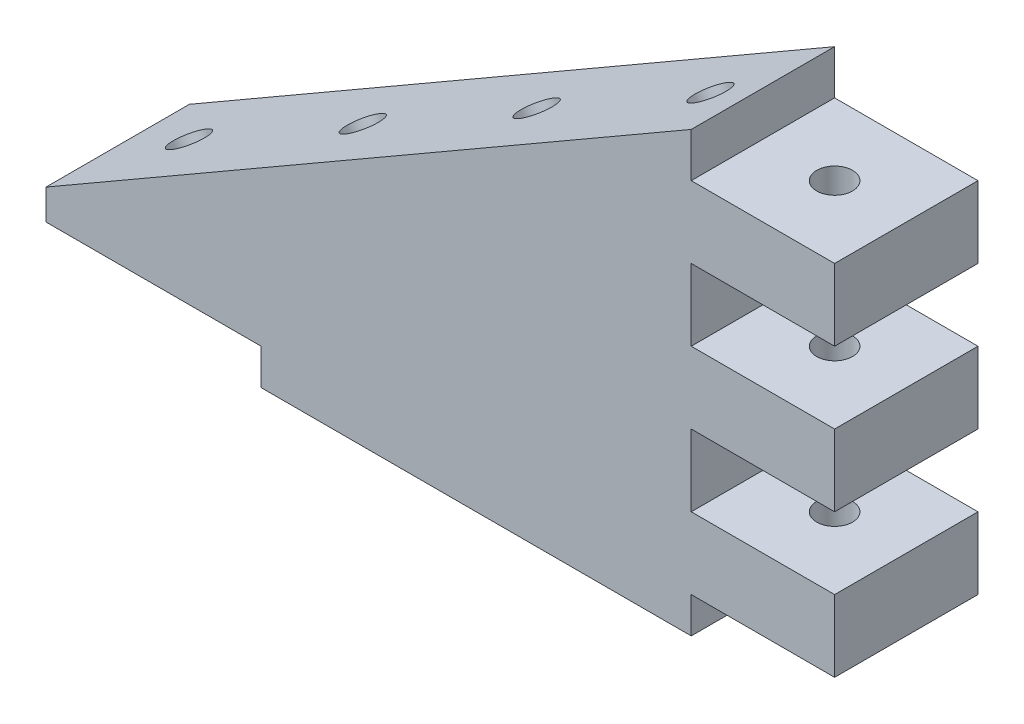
from build123d import *

# Parameters (mm, degrees)
BOSS_EXTRUDE1_DEPTH = 10
SKETCH3_W           = 20
SKETCH3_H           = 10
CUT_EXTRUDE1_DEPTH  = 122.999367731
SKETCH4_W           = 20
SKETCH4_H           = 10
CUT_EXTRUDE2_DEPTH  = 122.999367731
SKETCH6_R           = 2.5
CUT_EXTRUDE4_DEPTH  = 119.064518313
SKETCH7_R           = 2.5
CUT_EXTRUDE5_DEPTH  = 5
LPATTERN1_COUNT     = 4
LPATTERN1_PITCH     = 28
LPATTERN2_COUNT     = 4
LPATTERN2_PITCH     = 20
SKETCH8_W           = 30
SKETCH8_H           = 5
CUT_EXTRUDE6_DEPTH  = 119.928440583
SKETCH9_R           = 2.5
CUT_EXTRUDE7_DEPTH  = 5


with BuildPart() as part:
    # Sketch1 → Boss-Extrude1 (new, symmetric)
    with BuildSketch(Plane.XY):
        Polygon((10, 0), (10, 66.961524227), (0, 66.961524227), (-100, 9.226497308), (-100, 0), align=None)
    extrude(amount=BOSS_EXTRUDE1_DEPTH, both=True)

    # Sketch3 → Cut-Extrude1 (cut, through all)
    with BuildSketch(Plane.XY.offset(10)):
        Rectangle(SKETCH3_W, SKETCH3_H)
    cut_extrude1 = extrude(amount=-CUT_EXTRUDE1_DEPTH, mode=Mode.SUBTRACT)

    # Sketch4 → Cut-Extrude2 (cut, through all)
    with BuildSketch(Plane.XY.offset(10)):
        with Locations((0, 66.961524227)):
            Rectangle(SKETCH4_W, SKETCH4_H)
    extrude(amount=-CUT_EXTRUDE2_DEPTH, mode=Mode.SUBTRACT)

    # Sketch6 → Cut-Extrude4 (cut, through all)
    with BuildSketch(Plane(origin=(0, 61.961524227, 0), x_dir=(1, 0, 0), z_dir=(0, 1, 0))):
        with Locations(Location((0, 0, 0), (0, 0, 270))):
            Circle(SKETCH6_R)
    extrude(amount=-CUT_EXTRUDE4_DEPTH, mode=Mode.SUBTRACT)

    # Sketch7 → Cut-Extrude5 (cut)
    with BuildSketch(Plane(origin=(-28.995190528, 50.22114317, 0), x_dir=(0.8660254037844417, 0.4999999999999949, 0), z_dir=(-0.4999999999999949, 0.8660254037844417, 0))):
        with Locations(Location((13.480762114, 0, 0), (0, 0, 180))):
            Circle(SKETCH7_R)
    cut_extrude5 = extrude(amount=-CUT_EXTRUDE5_DEPTH, mode=Mode.SUBTRACT)

    # LPattern1: Cut-Extrude5 ×4
    with Locations(*[Vector(-0.8660254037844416, -0.4999999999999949, 0) * (i * LPATTERN1_PITCH) for i in range(1, LPATTERN1_COUNT)]):
        add(cut_extrude5, mode=Mode.SUBTRACT)

    # LPattern2: Cut-Extrude1 ×4
    with Locations(*[(0, i * LPATTERN2_PITCH, 0) for i in range(1, LPATTERN2_COUNT)]):
        add(cut_extrude1, mode=Mode.SUBTRACT)

    # Sketch8 → Cut-Extrude6 (cut, through all)
    with BuildSketch(Plane.XY.offset(10)):
        with Locations((-85, 2.5)):
            Rectangle(SKETCH8_W, SKETCH8_H)
    extrude(amount=-CUT_EXTRUDE6_DEPTH, mode=Mode.SUBTRACT)

    # Sketch9 → Cut-Extrude7 (cut)
    with BuildSketch(Plane.XZ.offset(-5)):
        with Locations(Location((-80, 0, 0), (0, 0, 270))):
            Circle(SKETCH9_R)
    extrude(amount=-CUT_EXTRUDE7_DEPTH, mode=Mode.SUBTRACT)


solid = part.part
